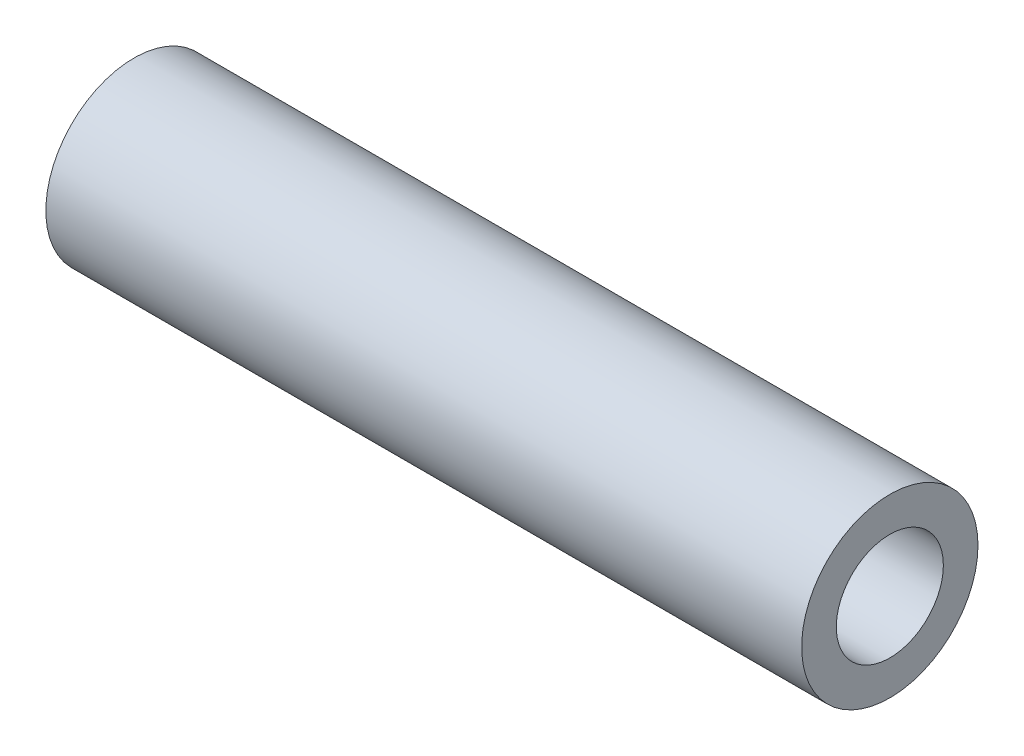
ISO-10303-21;
HEADER;
FILE_DESCRIPTION(('STEP AP214'),'2;1');
FILE_NAME('part.step','',(''),(''),'','','');
FILE_SCHEMA(('AUTOMOTIVE_DESIGN { 1 0 10303 214 1 1 1 1 }'));
ENDSEC;
DATA;
#1=APPLICATION_CONTEXT('core data for automotive mechanical design processes');
#2=APPLICATION_PROTOCOL_DEFINITION('international standard','automotive_design',2000,#1);
#3=PRODUCT_CONTEXT('',#1,'mechanical');
#4=PRODUCT('Part','Part','',(#3));
#5=PRODUCT_RELATED_PRODUCT_CATEGORY('part','',(#4));
#6=PRODUCT_DEFINITION_FORMATION('','',#4);
#7=PRODUCT_DEFINITION_CONTEXT('part definition',#1,'design');
#8=PRODUCT_DEFINITION('design','',#6,#7);
#9=PRODUCT_DEFINITION_SHAPE('','',#8);
#10=(LENGTH_UNIT() NAMED_UNIT(*) SI_UNIT(.MILLI.,.METRE.));
#11=(NAMED_UNIT(*) PLANE_ANGLE_UNIT() SI_UNIT($,.RADIAN.));
#12=(NAMED_UNIT(*) SI_UNIT($,.STERADIAN.) SOLID_ANGLE_UNIT());
#13=UNCERTAINTY_MEASURE_WITH_UNIT(LENGTH_MEASURE(1.E-05),#10,'distance_accuracy_value','');
#14=(GEOMETRIC_REPRESENTATION_CONTEXT(3) GLOBAL_UNCERTAINTY_ASSIGNED_CONTEXT((#13)) GLOBAL_UNIT_ASSIGNED_CONTEXT((#10,
#11,#12)) REPRESENTATION_CONTEXT('',''));
#15=CARTESIAN_POINT('',(0.,0.,0.));
#16=DIRECTION('',(0.,0.,1.));
#17=DIRECTION('',(1.,0.,0.));
#18=AXIS2_PLACEMENT_3D('',#15,#16,#17);
#19=CARTESIAN_POINT('',(0.,0.,0.));
#20=DIRECTION('',(1.,0.,0.));
#21=DIRECTION('',(0.,0.,-1.));
#22=AXIS2_PLACEMENT_3D('',#19,#20,#21);
#23=CYLINDRICAL_SURFACE('',#22,7.00000000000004);
#24=CARTESIAN_POINT('',(-257.5,0.,0.));
#25=DIRECTION('',(1.,0.,0.));
#26=DIRECTION('',(0.,0.,-1.));
#27=AXIS2_PLACEMENT_3D('',#24,#25,#26);
#28=CIRCLE('',#27,7.00000000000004);
#29=CARTESIAN_POINT('',(-257.5,0.,-7.00000000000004));
#30=VERTEX_POINT('',#29);
#31=EDGE_CURVE('E10',#30,#30,#28,.T.);
#32=ORIENTED_EDGE('',*,*,#31,.F.);
#33=EDGE_LOOP('',(#32));
#34=FACE_BOUND('',#33,.T.);
#35=CARTESIAN_POINT('',(-317.5,0.,0.));
#36=DIRECTION('',(1.,0.,0.));
#37=DIRECTION('',(0.,0.,-1.));
#38=AXIS2_PLACEMENT_3D('',#35,#36,#37);
#39=CIRCLE('',#38,7.00000000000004);
#40=CARTESIAN_POINT('',(-317.5,0.,-7.00000000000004));
#41=VERTEX_POINT('',#40);
#42=EDGE_CURVE('E40',#41,#41,#39,.T.);
#43=ORIENTED_EDGE('',*,*,#42,.T.);
#44=EDGE_LOOP('',(#43));
#45=FACE_BOUND('',#44,.T.);
#46=ADVANCED_FACE('F26',(#34,#45),#23,.T.);
#47=CARTESIAN_POINT('',(-257.5,7.00000000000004,0.));
#48=DIRECTION('',(-1.,0.,0.));
#49=DIRECTION('',(0.,0.,1.));
#50=AXIS2_PLACEMENT_3D('',#47,#48,#49);
#51=PLANE('',#50);
#52=CARTESIAN_POINT('',(-257.5,0.,0.));
#53=DIRECTION('',(1.,0.,0.));
#54=DIRECTION('',(0.,0.,-1.));
#55=AXIS2_PLACEMENT_3D('',#52,#53,#54);
#56=CIRCLE('',#55,4.25000000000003);
#57=CARTESIAN_POINT('',(-257.5,0.,-4.25000000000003));
#58=VERTEX_POINT('',#57);
#59=EDGE_CURVE('E32',#58,#58,#56,.T.);
#60=ORIENTED_EDGE('',*,*,#59,.F.);
#61=EDGE_LOOP('',(#60));
#62=FACE_BOUND('',#61,.T.);
#63=ORIENTED_EDGE('',*,*,#31,.T.);
#64=EDGE_LOOP('',(#63));
#65=FACE_BOUND('',#64,.T.);
#66=ADVANCED_FACE('F55',(#62,#65),#51,.F.);
#67=CARTESIAN_POINT('',(0.,0.,0.));
#68=DIRECTION('',(1.,0.,0.));
#69=DIRECTION('',(0.,0.,-1.));
#70=AXIS2_PLACEMENT_3D('',#67,#68,#69);
#71=CYLINDRICAL_SURFACE('',#70,4.25000000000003);
#72=CARTESIAN_POINT('',(-317.5,0.,0.));
#73=DIRECTION('',(1.,0.,0.));
#74=DIRECTION('',(0.,0.,-1.));
#75=AXIS2_PLACEMENT_3D('',#72,#73,#74);
#76=CIRCLE('',#75,4.25000000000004);
#77=CARTESIAN_POINT('',(-317.5,0.,-4.25000000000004));
#78=VERTEX_POINT('',#77);
#79=EDGE_CURVE('E36',#78,#78,#76,.T.);
#80=ORIENTED_EDGE('',*,*,#79,.F.);
#81=EDGE_LOOP('',(#80));
#82=FACE_BOUND('',#81,.T.);
#83=ORIENTED_EDGE('',*,*,#59,.T.);
#84=EDGE_LOOP('',(#83));
#85=FACE_BOUND('',#84,.T.);
#86=ADVANCED_FACE('F49',(#82,#85),#71,.F.);
#87=CARTESIAN_POINT('',(-317.5,7.00000000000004,0.));
#88=DIRECTION('',(-1.,0.,0.));
#89=DIRECTION('',(0.,0.,1.));
#90=AXIS2_PLACEMENT_3D('',#87,#88,#89);
#91=PLANE('',#90);
#92=ORIENTED_EDGE('',*,*,#79,.T.);
#93=EDGE_LOOP('',(#92));
#94=FACE_BOUND('',#93,.T.);
#95=ORIENTED_EDGE('',*,*,#42,.F.);
#96=EDGE_LOOP('',(#95));
#97=FACE_BOUND('',#96,.T.);
#98=ADVANCED_FACE('F47',(#94,#97),#91,.T.);
#99=CLOSED_SHELL('',(#46,#66,#86,#98));
#100=MANIFOLD_SOLID_BREP('B2',#99);
#101=ADVANCED_BREP_SHAPE_REPRESENTATION('',(#18,#100),#14);
#102=SHAPE_DEFINITION_REPRESENTATION(#9,#101);
ENDSEC;
END-ISO-10303-21;
